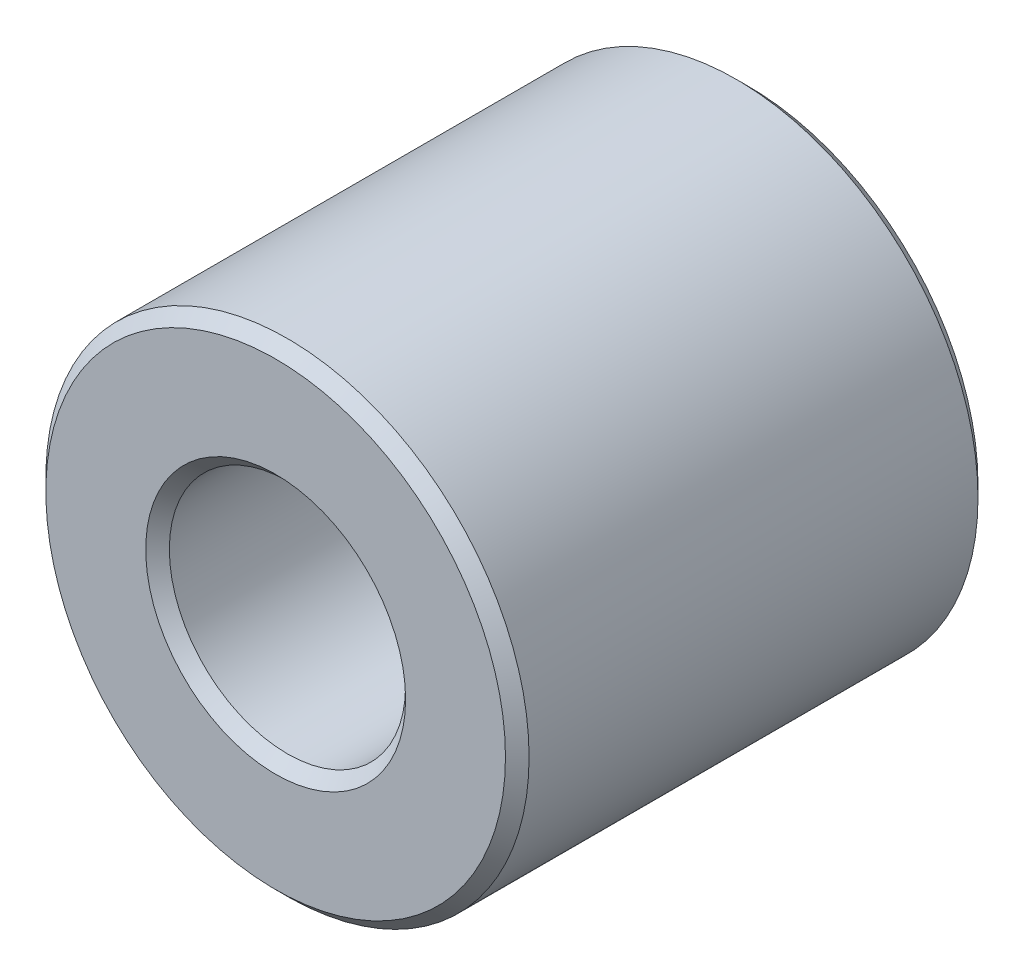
from build123d import *

# Parameters (mm, degrees)
SKETCH1_R           = 22.5
SKETCH1_R_2         = 11
BOSS_EXTRUDE1_DEPTH = 22
CHAMFER1_SIZE       = 1.1


with BuildPart() as part:
    # Sketch1 → Boss-Extrude1 (new, symmetric)
    with BuildSketch(Plane.XY):
        Circle(SKETCH1_R)
        Circle(SKETCH1_R_2, mode=Mode.SUBTRACT)
    extrude(amount=BOSS_EXTRUDE1_DEPTH, both=True)

    # Chamfer1
    chamfer1_edges = [part.edges().sort_by_distance(p)[0] for p in [
        (-22.5, 0, -22),
        (-22.5, 0, 22),
        (-11, 0, -22),
        (-11, 0, 22),
    ]]
    chamfer(chamfer1_edges, length=CHAMFER1_SIZE)


solid = part.part
